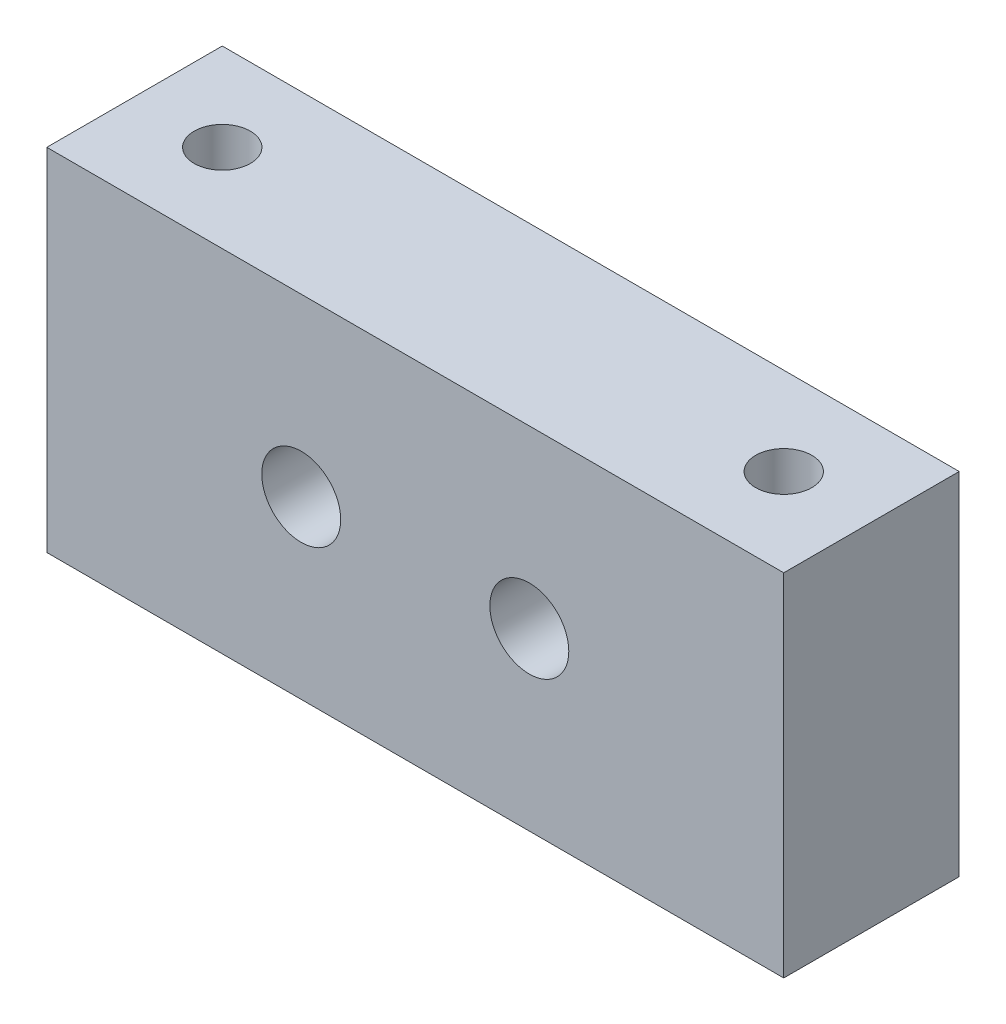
ISO-10303-21;
HEADER;
FILE_DESCRIPTION(('STEP AP214'),'2;1');
FILE_NAME('part.step','',(''),(''),'','','');
FILE_SCHEMA(('AUTOMOTIVE_DESIGN { 1 0 10303 214 1 1 1 1 }'));
ENDSEC;
DATA;
#1=APPLICATION_CONTEXT('core data for automotive mechanical design processes');
#2=APPLICATION_PROTOCOL_DEFINITION('international standard','automotive_design',2000,#1);
#3=PRODUCT_CONTEXT('',#1,'mechanical');
#4=PRODUCT('Part','Part','',(#3));
#5=PRODUCT_RELATED_PRODUCT_CATEGORY('part','',(#4));
#6=PRODUCT_DEFINITION_FORMATION('','',#4);
#7=PRODUCT_DEFINITION_CONTEXT('part definition',#1,'design');
#8=PRODUCT_DEFINITION('design','',#6,#7);
#9=PRODUCT_DEFINITION_SHAPE('','',#8);
#10=(LENGTH_UNIT() NAMED_UNIT(*) SI_UNIT(.MILLI.,.METRE.));
#11=(NAMED_UNIT(*) PLANE_ANGLE_UNIT() SI_UNIT($,.RADIAN.));
#12=(NAMED_UNIT(*) SI_UNIT($,.STERADIAN.) SOLID_ANGLE_UNIT());
#13=UNCERTAINTY_MEASURE_WITH_UNIT(LENGTH_MEASURE(1.E-05),#10,'distance_accuracy_value','');
#14=(GEOMETRIC_REPRESENTATION_CONTEXT(3) GLOBAL_UNCERTAINTY_ASSIGNED_CONTEXT((#13)) GLOBAL_UNIT_ASSIGNED_CONTEXT((#10,
#11,#12)) REPRESENTATION_CONTEXT('',''));
#15=CARTESIAN_POINT('',(0.,0.,0.));
#16=DIRECTION('',(0.,0.,1.));
#17=DIRECTION('',(1.,0.,0.));
#18=AXIS2_PLACEMENT_3D('',#15,#16,#17);
#19=CARTESIAN_POINT('',(-21.,-10.,10.));
#20=DIRECTION('',(-1.,0.,0.));
#21=DIRECTION('',(0.,0.,1.));
#22=AXIS2_PLACEMENT_3D('',#19,#20,#21);
#23=PLANE('',#22);
#24=DIRECTION('',(0.,1.,0.));
#25=VECTOR('',#24,1.);
#26=CARTESIAN_POINT('',(-21.,-10.,0.));
#27=LINE('',#26,#25);
#28=CARTESIAN_POINT('',(-21.,-10.,0.));
#29=VERTEX_POINT('',#28);
#30=CARTESIAN_POINT('',(-21.,10.,0.));
#31=VERTEX_POINT('',#30);
#32=EDGE_CURVE('E100',#29,#31,#27,.T.);
#33=ORIENTED_EDGE('',*,*,#32,.F.);
#34=DIRECTION('',(0.,0.,-1.));
#35=VECTOR('',#34,1.);
#36=CARTESIAN_POINT('',(-21.,-10.,10.));
#37=LINE('',#36,#35);
#38=CARTESIAN_POINT('',(-21.,-10.,10.));
#39=VERTEX_POINT('',#38);
#40=EDGE_CURVE('E11',#39,#29,#37,.T.);
#41=ORIENTED_EDGE('',*,*,#40,.F.);
#42=DIRECTION('',(0.,1.,0.));
#43=VECTOR('',#42,1.);
#44=CARTESIAN_POINT('',(-21.,-10.,10.));
#45=LINE('',#44,#43);
#46=CARTESIAN_POINT('',(-21.,10.,10.));
#47=VERTEX_POINT('',#46);
#48=EDGE_CURVE('E94',#39,#47,#45,.T.);
#49=ORIENTED_EDGE('',*,*,#48,.T.);
#50=DIRECTION('',(0.,0.,-1.));
#51=VECTOR('',#50,1.);
#52=CARTESIAN_POINT('',(-21.,10.,10.));
#53=LINE('',#52,#51);
#54=EDGE_CURVE('E37',#47,#31,#53,.T.);
#55=ORIENTED_EDGE('',*,*,#54,.T.);
#56=EDGE_LOOP('',(#33,#41,#49,#55));
#57=FACE_BOUND('',#56,.T.);
#58=ADVANCED_FACE('F34',(#57),#23,.T.);
#59=CARTESIAN_POINT('',(-21.,-10.,10.));
#60=DIRECTION('',(0.,1.,0.));
#61=DIRECTION('',(0.,0.,1.));
#62=AXIS2_PLACEMENT_3D('',#59,#60,#61);
#63=PLANE('',#62);
#64=CARTESIAN_POINT('',(16.,-10.,5.));
#65=DIRECTION('',(0.,1.,0.));
#66=DIRECTION('',(0.,0.,1.));
#67=AXIS2_PLACEMENT_3D('',#64,#65,#66);
#68=CIRCLE('',#67,1.60000000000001);
#69=CARTESIAN_POINT('',(16.,-10.,6.6));
#70=VERTEX_POINT('',#69);
#71=EDGE_CURVE('E140',#70,#70,#68,.T.);
#72=ORIENTED_EDGE('',*,*,#71,.T.);
#73=EDGE_LOOP('',(#72));
#74=FACE_BOUND('',#73,.T.);
#75=CARTESIAN_POINT('',(-16.,-10.,5.));
#76=DIRECTION('',(0.,1.,0.));
#77=DIRECTION('',(0.,0.,1.));
#78=AXIS2_PLACEMENT_3D('',#75,#76,#77);
#79=CIRCLE('',#78,1.6);
#80=CARTESIAN_POINT('',(-16.,-10.,6.6));
#81=VERTEX_POINT('',#80);
#82=EDGE_CURVE('E139',#81,#81,#79,.T.);
#83=ORIENTED_EDGE('',*,*,#82,.T.);
#84=EDGE_LOOP('',(#83));
#85=FACE_BOUND('',#84,.T.);
#86=DIRECTION('',(1.,0.,0.));
#87=VECTOR('',#86,1.);
#88=CARTESIAN_POINT('',(-21.,-10.,0.));
#89=LINE('',#88,#87);
#90=CARTESIAN_POINT('',(21.,-10.,0.));
#91=VERTEX_POINT('',#90);
#92=EDGE_CURVE('E67',#29,#91,#89,.T.);
#93=ORIENTED_EDGE('',*,*,#92,.T.);
#94=DIRECTION('',(0.,0.,-1.));
#95=VECTOR('',#94,1.);
#96=CARTESIAN_POINT('',(21.,-10.,10.));
#97=LINE('',#96,#95);
#98=CARTESIAN_POINT('',(21.,-10.,10.));
#99=VERTEX_POINT('',#98);
#100=EDGE_CURVE('E43',#99,#91,#97,.T.);
#101=ORIENTED_EDGE('',*,*,#100,.F.);
#102=DIRECTION('',(1.,0.,0.));
#103=VECTOR('',#102,1.);
#104=CARTESIAN_POINT('',(-21.,-10.,10.));
#105=LINE('',#104,#103);
#106=EDGE_CURVE('E84',#39,#99,#105,.T.);
#107=ORIENTED_EDGE('',*,*,#106,.F.);
#108=ORIENTED_EDGE('',*,*,#40,.T.);
#109=EDGE_LOOP('',(#93,#101,#107,#108));
#110=FACE_BOUND('',#109,.T.);
#111=ADVANCED_FACE('F111',(#74,#85,#110),#63,.F.);
#112=CARTESIAN_POINT('',(21.,-10.,10.));
#113=DIRECTION('',(-1.,0.,0.));
#114=DIRECTION('',(0.,0.,1.));
#115=AXIS2_PLACEMENT_3D('',#112,#113,#114);
#116=PLANE('',#115);
#117=DIRECTION('',(0.,1.,0.));
#118=VECTOR('',#117,1.);
#119=CARTESIAN_POINT('',(21.,-10.,0.));
#120=LINE('',#119,#118);
#121=CARTESIAN_POINT('',(21.,10.,0.));
#122=VERTEX_POINT('',#121);
#123=EDGE_CURVE('E91',#91,#122,#120,.T.);
#124=ORIENTED_EDGE('',*,*,#123,.T.);
#125=DIRECTION('',(0.,0.,-1.));
#126=VECTOR('',#125,1.);
#127=CARTESIAN_POINT('',(21.,10.,10.));
#128=LINE('',#127,#126);
#129=CARTESIAN_POINT('',(21.,10.,10.));
#130=VERTEX_POINT('',#129);
#131=EDGE_CURVE('E88',#130,#122,#128,.T.);
#132=ORIENTED_EDGE('',*,*,#131,.F.);
#133=DIRECTION('',(0.,1.,0.));
#134=VECTOR('',#133,1.);
#135=CARTESIAN_POINT('',(21.,-10.,10.));
#136=LINE('',#135,#134);
#137=EDGE_CURVE('E79',#99,#130,#136,.T.);
#138=ORIENTED_EDGE('',*,*,#137,.F.);
#139=ORIENTED_EDGE('',*,*,#100,.T.);
#140=EDGE_LOOP('',(#124,#132,#138,#139));
#141=FACE_BOUND('',#140,.T.);
#142=ADVANCED_FACE('F89',(#141),#116,.F.);
#143=CARTESIAN_POINT('',(-21.,10.,10.));
#144=DIRECTION('',(0.,1.,0.));
#145=DIRECTION('',(0.,0.,1.));
#146=AXIS2_PLACEMENT_3D('',#143,#144,#145);
#147=PLANE('',#146);
#148=CARTESIAN_POINT('',(16.,10.,5.));
#149=DIRECTION('',(0.,1.,0.));
#150=DIRECTION('',(0.,0.,1.));
#151=AXIS2_PLACEMENT_3D('',#148,#149,#150);
#152=CIRCLE('',#151,1.60000000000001);
#153=CARTESIAN_POINT('',(16.,10.,6.6));
#154=VERTEX_POINT('',#153);
#155=EDGE_CURVE('E134',#154,#154,#152,.T.);
#156=ORIENTED_EDGE('',*,*,#155,.F.);
#157=EDGE_LOOP('',(#156));
#158=FACE_BOUND('',#157,.T.);
#159=CARTESIAN_POINT('',(-16.,10.,5.));
#160=DIRECTION('',(0.,1.,0.));
#161=DIRECTION('',(0.,0.,1.));
#162=AXIS2_PLACEMENT_3D('',#159,#160,#161);
#163=CIRCLE('',#162,1.6);
#164=CARTESIAN_POINT('',(-16.,10.,6.6));
#165=VERTEX_POINT('',#164);
#166=EDGE_CURVE('E137',#165,#165,#163,.T.);
#167=ORIENTED_EDGE('',*,*,#166,.F.);
#168=EDGE_LOOP('',(#167));
#169=FACE_BOUND('',#168,.T.);
#170=DIRECTION('',(1.,0.,0.));
#171=VECTOR('',#170,1.);
#172=CARTESIAN_POINT('',(-21.,10.,0.));
#173=LINE('',#172,#171);
#174=EDGE_CURVE('E103',#31,#122,#173,.T.);
#175=ORIENTED_EDGE('',*,*,#174,.F.);
#176=ORIENTED_EDGE('',*,*,#54,.F.);
#177=DIRECTION('',(1.,0.,0.));
#178=VECTOR('',#177,1.);
#179=CARTESIAN_POINT('',(-21.,10.,10.));
#180=LINE('',#179,#178);
#181=EDGE_CURVE('E83',#47,#130,#180,.T.);
#182=ORIENTED_EDGE('',*,*,#181,.T.);
#183=ORIENTED_EDGE('',*,*,#131,.T.);
#184=EDGE_LOOP('',(#175,#176,#182,#183));
#185=FACE_BOUND('',#184,.T.);
#186=ADVANCED_FACE('F93',(#158,#169,#185),#147,.T.);
#187=CARTESIAN_POINT('',(0.,0.,10.));
#188=DIRECTION('',(0.,0.,-1.));
#189=DIRECTION('',(-1.,0.,0.));
#190=AXIS2_PLACEMENT_3D('',#187,#188,#189);
#191=PLANE('',#190);
#192=CARTESIAN_POINT('',(6.5,0.,10.));
#193=DIRECTION('',(0.,0.,1.));
#194=DIRECTION('',(1.,0.,0.));
#195=AXIS2_PLACEMENT_3D('',#192,#193,#194);
#196=CIRCLE('',#195,2.25);
#197=CARTESIAN_POINT('',(8.75,0.,10.));
#198=VERTEX_POINT('',#197);
#199=EDGE_CURVE('E143',#198,#198,#196,.T.);
#200=ORIENTED_EDGE('',*,*,#199,.F.);
#201=EDGE_LOOP('',(#200));
#202=FACE_BOUND('',#201,.T.);
#203=CARTESIAN_POINT('',(-6.5,0.,10.));
#204=DIRECTION('',(0.,0.,1.));
#205=DIRECTION('',(1.,0.,0.));
#206=AXIS2_PLACEMENT_3D('',#203,#204,#205);
#207=CIRCLE('',#206,2.25);
#208=CARTESIAN_POINT('',(-4.25,0.,10.));
#209=VERTEX_POINT('',#208);
#210=EDGE_CURVE('E151',#209,#209,#207,.T.);
#211=ORIENTED_EDGE('',*,*,#210,.F.);
#212=EDGE_LOOP('',(#211));
#213=FACE_BOUND('',#212,.T.);
#214=ORIENTED_EDGE('',*,*,#48,.F.);
#215=ORIENTED_EDGE('',*,*,#106,.T.);
#216=ORIENTED_EDGE('',*,*,#137,.T.);
#217=ORIENTED_EDGE('',*,*,#181,.F.);
#218=EDGE_LOOP('',(#214,#215,#216,#217));
#219=FACE_BOUND('',#218,.T.);
#220=ADVANCED_FACE('F82',(#202,#213,#219),#191,.F.);
#221=CARTESIAN_POINT('',(0.,0.,0.));
#222=DIRECTION('',(0.,0.,-1.));
#223=DIRECTION('',(-1.,0.,0.));
#224=AXIS2_PLACEMENT_3D('',#221,#222,#223);
#225=PLANE('',#224);
#226=CARTESIAN_POINT('',(6.5,0.,0.));
#227=DIRECTION('',(0.,0.,1.));
#228=DIRECTION('',(1.,0.,0.));
#229=AXIS2_PLACEMENT_3D('',#226,#227,#228);
#230=CIRCLE('',#229,2.25);
#231=CARTESIAN_POINT('',(8.75,0.,0.));
#232=VERTEX_POINT('',#231);
#233=EDGE_CURVE('E148',#232,#232,#230,.T.);
#234=ORIENTED_EDGE('',*,*,#233,.T.);
#235=EDGE_LOOP('',(#234));
#236=FACE_BOUND('',#235,.T.);
#237=CARTESIAN_POINT('',(-6.5,0.,0.));
#238=DIRECTION('',(0.,0.,1.));
#239=DIRECTION('',(1.,0.,0.));
#240=AXIS2_PLACEMENT_3D('',#237,#238,#239);
#241=CIRCLE('',#240,2.25);
#242=CARTESIAN_POINT('',(-4.25,0.,0.));
#243=VERTEX_POINT('',#242);
#244=EDGE_CURVE('E104',#243,#243,#241,.T.);
#245=ORIENTED_EDGE('',*,*,#244,.T.);
#246=EDGE_LOOP('',(#245));
#247=FACE_BOUND('',#246,.T.);
#248=ORIENTED_EDGE('',*,*,#32,.T.);
#249=ORIENTED_EDGE('',*,*,#174,.T.);
#250=ORIENTED_EDGE('',*,*,#123,.F.);
#251=ORIENTED_EDGE('',*,*,#92,.F.);
#252=EDGE_LOOP('',(#248,#249,#250,#251));
#253=FACE_BOUND('',#252,.T.);
#254=ADVANCED_FACE('F109',(#236,#247,#253),#225,.T.);
#255=CARTESIAN_POINT('',(-6.5,0.,0.));
#256=DIRECTION('',(0.,0.,1.));
#257=DIRECTION('',(1.,0.,0.));
#258=AXIS2_PLACEMENT_3D('',#255,#256,#257);
#259=CYLINDRICAL_SURFACE('',#258,2.25);
#260=ORIENTED_EDGE('',*,*,#244,.F.);
#261=EDGE_LOOP('',(#260));
#262=FACE_BOUND('',#261,.T.);
#263=ORIENTED_EDGE('',*,*,#210,.T.);
#264=EDGE_LOOP('',(#263));
#265=FACE_BOUND('',#264,.T.);
#266=ADVANCED_FACE('F158',(#262,#265),#259,.F.);
#267=CARTESIAN_POINT('',(6.5,0.,0.));
#268=DIRECTION('',(0.,0.,1.));
#269=DIRECTION('',(1.,0.,0.));
#270=AXIS2_PLACEMENT_3D('',#267,#268,#269);
#271=CYLINDRICAL_SURFACE('',#270,2.25);
#272=ORIENTED_EDGE('',*,*,#233,.F.);
#273=EDGE_LOOP('',(#272));
#274=FACE_BOUND('',#273,.T.);
#275=ORIENTED_EDGE('',*,*,#199,.T.);
#276=EDGE_LOOP('',(#275));
#277=FACE_BOUND('',#276,.T.);
#278=ADVANCED_FACE('F161',(#274,#277),#271,.F.);
#279=CARTESIAN_POINT('',(-16.,-10.,5.));
#280=DIRECTION('',(0.,1.,0.));
#281=DIRECTION('',(0.,0.,1.));
#282=AXIS2_PLACEMENT_3D('',#279,#280,#281);
#283=CYLINDRICAL_SURFACE('',#282,1.6);
#284=ORIENTED_EDGE('',*,*,#82,.F.);
#285=EDGE_LOOP('',(#284));
#286=FACE_BOUND('',#285,.T.);
#287=ORIENTED_EDGE('',*,*,#166,.T.);
#288=EDGE_LOOP('',(#287));
#289=FACE_BOUND('',#288,.T.);
#290=ADVANCED_FACE('F168',(#286,#289),#283,.F.);
#291=CARTESIAN_POINT('',(16.,-10.,5.));
#292=DIRECTION('',(0.,1.,0.));
#293=DIRECTION('',(0.,0.,1.));
#294=AXIS2_PLACEMENT_3D('',#291,#292,#293);
#295=CYLINDRICAL_SURFACE('',#294,1.60000000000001);
#296=ORIENTED_EDGE('',*,*,#71,.F.);
#297=EDGE_LOOP('',(#296));
#298=FACE_BOUND('',#297,.T.);
#299=ORIENTED_EDGE('',*,*,#155,.T.);
#300=EDGE_LOOP('',(#299));
#301=FACE_BOUND('',#300,.T.);
#302=ADVANCED_FACE('F176',(#298,#301),#295,.F.);
#303=CLOSED_SHELL('',(#58,#111,#142,#186,#220,#254,#266,#278,#290,#302));
#304=MANIFOLD_SOLID_BREP('B2',#303);
#305=ADVANCED_BREP_SHAPE_REPRESENTATION('',(#18,#304),#14);
#306=SHAPE_DEFINITION_REPRESENTATION(#9,#305);
ENDSEC;
END-ISO-10303-21;
